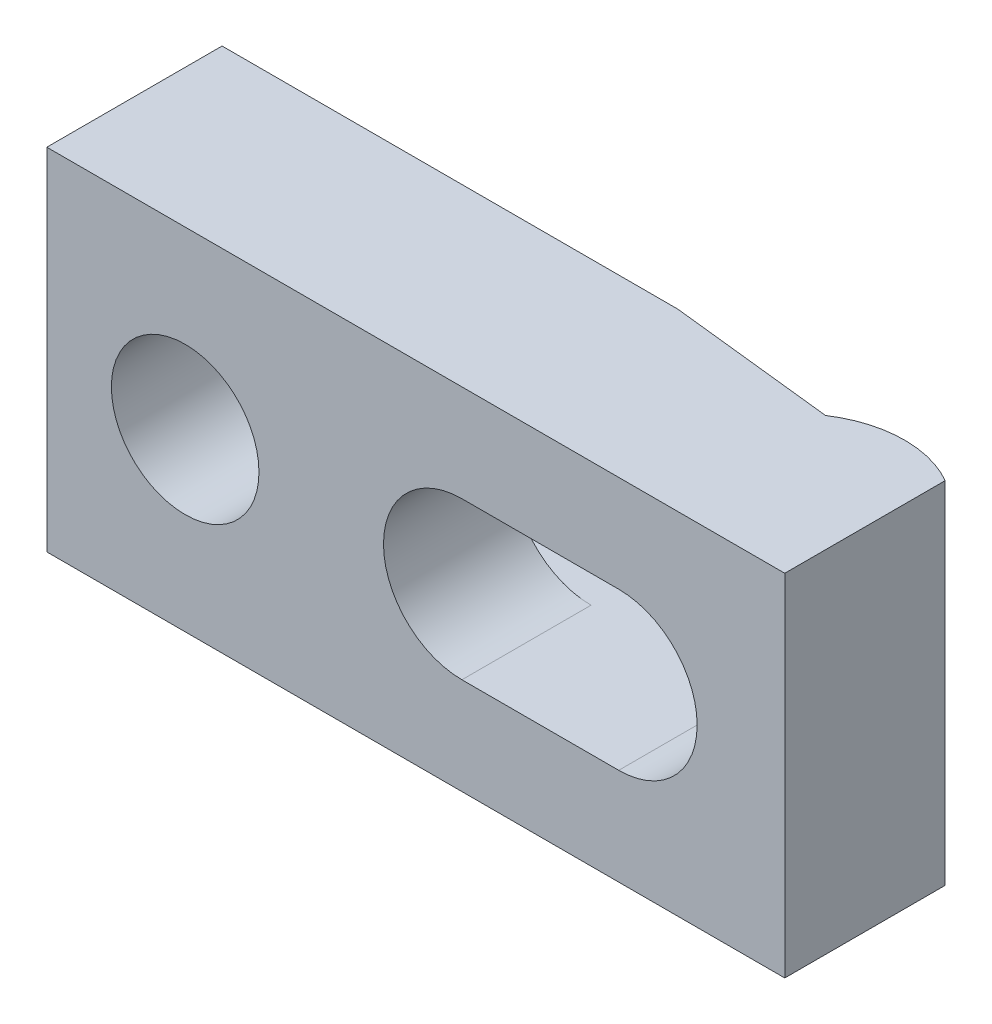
ISO-10303-21;
HEADER;
FILE_DESCRIPTION(('STEP AP214'),'2;1');
FILE_NAME('part.step','',(''),(''),'','','');
FILE_SCHEMA(('AUTOMOTIVE_DESIGN { 1 0 10303 214 1 1 1 1 }'));
ENDSEC;
DATA;
#1=APPLICATION_CONTEXT('core data for automotive mechanical design processes');
#2=APPLICATION_PROTOCOL_DEFINITION('international standard','automotive_design',2000,#1);
#3=PRODUCT_CONTEXT('',#1,'mechanical');
#4=PRODUCT('Part','Part','',(#3));
#5=PRODUCT_RELATED_PRODUCT_CATEGORY('part','',(#4));
#6=PRODUCT_DEFINITION_FORMATION('','',#4);
#7=PRODUCT_DEFINITION_CONTEXT('part definition',#1,'design');
#8=PRODUCT_DEFINITION('design','',#6,#7);
#9=PRODUCT_DEFINITION_SHAPE('','',#8);
#10=(LENGTH_UNIT() NAMED_UNIT(*) SI_UNIT(.MILLI.,.METRE.));
#11=(NAMED_UNIT(*) PLANE_ANGLE_UNIT() SI_UNIT($,.RADIAN.));
#12=(NAMED_UNIT(*) SI_UNIT($,.STERADIAN.) SOLID_ANGLE_UNIT());
#13=UNCERTAINTY_MEASURE_WITH_UNIT(LENGTH_MEASURE(1.E-05),#10,'distance_accuracy_value','');
#14=(GEOMETRIC_REPRESENTATION_CONTEXT(3) GLOBAL_UNCERTAINTY_ASSIGNED_CONTEXT((#13)) GLOBAL_UNIT_ASSIGNED_CONTEXT((#10,
#11,#12)) REPRESENTATION_CONTEXT('',''));
#15=CARTESIAN_POINT('',(0.,0.,0.));
#16=DIRECTION('',(0.,0.,1.));
#17=DIRECTION('',(1.,0.,0.));
#18=AXIS2_PLACEMENT_3D('',#15,#16,#17);
#19=CARTESIAN_POINT('',(-62.,19.,0.));
#20=DIRECTION('',(0.,0.,-1.));
#21=DIRECTION('',(-1.,0.,0.));
#22=AXIS2_PLACEMENT_3D('',#19,#20,#21);
#23=PLANE('',#22);
#24=DIRECTION('',(1.,0.,0.));
#25=VECTOR('',#24,1.);
#26=CARTESIAN_POINT('',(-17.,8.5,0.));
#27=LINE('',#26,#25);
#28=CARTESIAN_POINT('',(-62.,8.5,0.));
#29=VERTEX_POINT('',#28);
#30=CARTESIAN_POINT('',(-12.6,8.5,0.));
#31=VERTEX_POINT('',#30);
#32=EDGE_CURVE('E127',#29,#31,#27,.T.);
#33=ORIENTED_EDGE('',*,*,#32,.F.);
#34=DIRECTION('',(0.,-1.,0.));
#35=VECTOR('',#34,1.);
#36=CARTESIAN_POINT('',(-62.,19.,0.));
#37=LINE('',#36,#35);
#38=CARTESIAN_POINT('',(-62.,19.,0.));
#39=VERTEX_POINT('',#38);
#40=EDGE_CURVE('E144',#39,#29,#37,.T.);
#41=ORIENTED_EDGE('',*,*,#40,.F.);
#42=DIRECTION('',(1.,0.,0.));
#43=VECTOR('',#42,1.);
#44=CARTESIAN_POINT('',(-62.,19.,0.));
#45=LINE('',#44,#43);
#46=CARTESIAN_POINT('',(-12.6,19.,0.));
#47=VERTEX_POINT('',#46);
#48=EDGE_CURVE('E264',#39,#47,#45,.T.);
#49=ORIENTED_EDGE('',*,*,#48,.T.);
#50=DIRECTION('',(0.,-1.,0.));
#51=VECTOR('',#50,1.);
#52=CARTESIAN_POINT('',(-12.6,19.,0.));
#53=LINE('',#52,#51);
#54=EDGE_CURVE('E152',#47,#31,#53,.T.);
#55=ORIENTED_EDGE('',*,*,#54,.T.);
#56=EDGE_LOOP('',(#33,#41,#49,#55));
#57=FACE_BOUND('',#56,.T.);
#58=ADVANCED_FACE('F14',(#57),#23,.T.);
#59=CARTESIAN_POINT('',(-62.,19.,19.));
#60=DIRECTION('',(-1.,0.,0.));
#61=DIRECTION('',(0.,0.,1.));
#62=AXIS2_PLACEMENT_3D('',#59,#60,#61);
#63=PLANE('',#62);
#64=ORIENTED_EDGE('',*,*,#40,.T.);
#65=DIRECTION('',(0.,0.,1.));
#66=VECTOR('',#65,1.);
#67=CARTESIAN_POINT('',(-62.,8.5,19.));
#68=LINE('',#67,#66);
#69=CARTESIAN_POINT('',(-62.,8.5,5.));
#70=VERTEX_POINT('',#69);
#71=EDGE_CURVE('E138',#29,#70,#68,.T.);
#72=ORIENTED_EDGE('',*,*,#71,.T.);
#73=DIRECTION('',(0.,-1.,0.));
#74=VECTOR('',#73,1.);
#75=CARTESIAN_POINT('',(-62.,19.,5.));
#76=LINE('',#75,#74);
#77=CARTESIAN_POINT('',(-62.,-8.5,5.));
#78=VERTEX_POINT('',#77);
#79=EDGE_CURVE('E137',#70,#78,#76,.T.);
#80=ORIENTED_EDGE('',*,*,#79,.T.);
#81=DIRECTION('',(0.,0.,1.));
#82=VECTOR('',#81,1.);
#83=CARTESIAN_POINT('',(-62.,-8.5,19.));
#84=LINE('',#83,#82);
#85=CARTESIAN_POINT('',(-62.,-8.5,0.));
#86=VERTEX_POINT('',#85);
#87=EDGE_CURVE('E120',#86,#78,#84,.T.);
#88=ORIENTED_EDGE('',*,*,#87,.F.);
#89=CARTESIAN_POINT('',(-62.,-19.,0.));
#90=VERTEX_POINT('',#89);
#91=EDGE_CURVE('E134',#86,#90,#37,.T.);
#92=ORIENTED_EDGE('',*,*,#91,.T.);
#93=DIRECTION('',(0.,0.,-1.));
#94=VECTOR('',#93,1.);
#95=CARTESIAN_POINT('',(-62.,-19.,19.));
#96=LINE('',#95,#94);
#97=CARTESIAN_POINT('',(-62.,-19.,19.));
#98=VERTEX_POINT('',#97);
#99=EDGE_CURVE('E287',#98,#90,#96,.T.);
#100=ORIENTED_EDGE('',*,*,#99,.F.);
#101=DIRECTION('',(0.,-1.,0.));
#102=VECTOR('',#101,1.);
#103=CARTESIAN_POINT('',(-62.,19.,19.));
#104=LINE('',#103,#102);
#105=CARTESIAN_POINT('',(-62.,19.,19.));
#106=VERTEX_POINT('',#105);
#107=EDGE_CURVE('E145',#106,#98,#104,.T.);
#108=ORIENTED_EDGE('',*,*,#107,.F.);
#109=DIRECTION('',(0.,0.,-1.));
#110=VECTOR('',#109,1.);
#111=CARTESIAN_POINT('',(-62.,19.,19.));
#112=LINE('',#111,#110);
#113=EDGE_CURVE('E260',#106,#39,#112,.T.);
#114=ORIENTED_EDGE('',*,*,#113,.T.);
#115=EDGE_LOOP('',(#64,#72,#80,#88,#92,#100,#108,#114));
#116=FACE_BOUND('',#115,.T.);
#117=ADVANCED_FACE('F132',(#116),#63,.T.);
#118=CARTESIAN_POINT('',(-17.,0.,19.));
#119=DIRECTION('',(0.,0.,-1.));
#120=DIRECTION('',(-1.,0.,0.));
#121=AXIS2_PLACEMENT_3D('',#118,#119,#120);
#122=CYLINDRICAL_SURFACE('',#121,8.5);
#123=DIRECTION('',(0.,0.,-1.));
#124=VECTOR('',#123,1.);
#125=CARTESIAN_POINT('',(-17.,-8.5,19.));
#126=LINE('',#125,#124);
#127=CARTESIAN_POINT('',(-17.,-8.5,19.));
#128=VERTEX_POINT('',#127);
#129=CARTESIAN_POINT('',(-17.,-8.5,5.));
#130=VERTEX_POINT('',#129);
#131=EDGE_CURVE('E176',#128,#130,#126,.T.);
#132=ORIENTED_EDGE('',*,*,#131,.T.);
#133=CARTESIAN_POINT('',(-17.,0.,5.));
#134=DIRECTION('',(0.,0.,-1.));
#135=DIRECTION('',(-1.,0.,0.));
#136=AXIS2_PLACEMENT_3D('',#133,#134,#135);
#137=CIRCLE('',#136,8.5);
#138=CARTESIAN_POINT('',(-17.,8.5,5.));
#139=VERTEX_POINT('',#138);
#140=EDGE_CURVE('E302',#130,#139,#137,.T.);
#141=ORIENTED_EDGE('',*,*,#140,.T.);
#142=DIRECTION('',(0.,0.,-1.));
#143=VECTOR('',#142,1.);
#144=CARTESIAN_POINT('',(-17.,8.5,19.));
#145=LINE('',#144,#143);
#146=CARTESIAN_POINT('',(-17.,8.5,19.));
#147=VERTEX_POINT('',#146);
#148=EDGE_CURVE('E178',#147,#139,#145,.T.);
#149=ORIENTED_EDGE('',*,*,#148,.F.);
#150=CARTESIAN_POINT('',(-17.,0.,19.));
#151=DIRECTION('',(0.,0.,1.));
#152=DIRECTION('',(1.,0.,0.));
#153=AXIS2_PLACEMENT_3D('',#150,#151,#152);
#154=CIRCLE('',#153,8.5);
#155=EDGE_CURVE('E38',#147,#128,#154,.T.);
#156=ORIENTED_EDGE('',*,*,#155,.T.);
#157=EDGE_LOOP('',(#132,#141,#149,#156));
#158=FACE_BOUND('',#157,.T.);
#159=ADVANCED_FACE('F215',(#158),#122,.F.);
#160=CARTESIAN_POINT('',(-47.,0.,19.));
#161=DIRECTION('',(0.,0.,-1.));
#162=DIRECTION('',(-1.,0.,0.));
#163=AXIS2_PLACEMENT_3D('',#160,#161,#162);
#164=CYLINDRICAL_SURFACE('',#163,8.);
#165=CARTESIAN_POINT('',(-47.,0.,19.));
#166=DIRECTION('',(0.,0.,1.));
#167=DIRECTION('',(1.,0.,0.));
#168=AXIS2_PLACEMENT_3D('',#165,#166,#167);
#169=CIRCLE('',#168,8.);
#170=CARTESIAN_POINT('',(-39.,0.,19.));
#171=VERTEX_POINT('',#170);
#172=EDGE_CURVE('E256',#171,#171,#169,.T.);
#173=ORIENTED_EDGE('',*,*,#172,.T.);
#174=EDGE_LOOP('',(#173));
#175=FACE_BOUND('',#174,.T.);
#176=CARTESIAN_POINT('',(-47.,0.,5.));
#177=DIRECTION('',(0.,0.,-1.));
#178=DIRECTION('',(-1.,0.,0.));
#179=AXIS2_PLACEMENT_3D('',#176,#177,#178);
#180=CIRCLE('',#179,8.);
#181=CARTESIAN_POINT('',(-55.,0.,5.));
#182=VERTEX_POINT('',#181);
#183=EDGE_CURVE('E18',#182,#182,#180,.T.);
#184=ORIENTED_EDGE('',*,*,#183,.T.);
#185=EDGE_LOOP('',(#184));
#186=FACE_BOUND('',#185,.T.);
#187=ADVANCED_FACE('F210',(#175,#186),#164,.F.);
#188=CARTESIAN_POINT('',(18.,19.,19.));
#189=DIRECTION('',(0.,0.,1.));
#190=DIRECTION('',(1.,0.,0.));
#191=AXIS2_PLACEMENT_3D('',#188,#189,#190);
#192=PLANE('',#191);
#193=DIRECTION('',(1.,0.,0.));
#194=VECTOR('',#193,1.);
#195=CARTESIAN_POINT('',(-17.,8.5,19.));
#196=LINE('',#195,#194);
#197=CARTESIAN_POINT('',(0.,8.5,19.));
#198=VERTEX_POINT('',#197);
#199=EDGE_CURVE('E296',#147,#198,#196,.T.);
#200=ORIENTED_EDGE('',*,*,#199,.T.);
#201=CARTESIAN_POINT('',(0.,0.,19.));
#202=DIRECTION('',(0.,0.,1.));
#203=DIRECTION('',(1.,0.,0.));
#204=AXIS2_PLACEMENT_3D('',#201,#202,#203);
#205=CIRCLE('',#204,8.5);
#206=CARTESIAN_POINT('',(0.,-8.5,19.));
#207=VERTEX_POINT('',#206);
#208=EDGE_CURVE('E126',#207,#198,#205,.T.);
#209=ORIENTED_EDGE('',*,*,#208,.F.);
#210=DIRECTION('',(-1.,0.,0.));
#211=VECTOR('',#210,1.);
#212=CARTESIAN_POINT('',(0.,-8.5,19.));
#213=LINE('',#212,#211);
#214=EDGE_CURVE('E174',#207,#128,#213,.T.);
#215=ORIENTED_EDGE('',*,*,#214,.T.);
#216=ORIENTED_EDGE('',*,*,#155,.F.);
#217=EDGE_LOOP('',(#200,#209,#215,#216));
#218=FACE_BOUND('',#217,.T.);
#219=DIRECTION('',(0.,-1.,0.));
#220=VECTOR('',#219,1.);
#221=CARTESIAN_POINT('',(18.,19.,19.));
#222=LINE('',#221,#220);
#223=CARTESIAN_POINT('',(18.,19.,19.));
#224=VERTEX_POINT('',#223);
#225=CARTESIAN_POINT('',(18.,-19.,19.));
#226=VERTEX_POINT('',#225);
#227=EDGE_CURVE('E161',#224,#226,#222,.T.);
#228=ORIENTED_EDGE('',*,*,#227,.F.);
#229=DIRECTION('',(-1.,0.,0.));
#230=VECTOR('',#229,1.);
#231=CARTESIAN_POINT('',(18.,19.,19.));
#232=LINE('',#231,#230);
#233=EDGE_CURVE('E265',#224,#106,#232,.T.);
#234=ORIENTED_EDGE('',*,*,#233,.T.);
#235=ORIENTED_EDGE('',*,*,#107,.T.);
#236=DIRECTION('',(-1.,0.,0.));
#237=VECTOR('',#236,1.);
#238=CARTESIAN_POINT('',(18.,-19.,19.));
#239=LINE('',#238,#237);
#240=EDGE_CURVE('E198',#226,#98,#239,.T.);
#241=ORIENTED_EDGE('',*,*,#240,.F.);
#242=EDGE_LOOP('',(#228,#234,#235,#241));
#243=FACE_BOUND('',#242,.T.);
#244=ORIENTED_EDGE('',*,*,#172,.F.);
#245=EDGE_LOOP('',(#244));
#246=FACE_BOUND('',#245,.T.);
#247=ADVANCED_FACE('F228',(#218,#243,#246),#192,.T.);
#248=ORIENTED_EDGE('',*,*,#91,.F.);
#249=DIRECTION('',(-1.,0.,0.));
#250=VECTOR('',#249,1.);
#251=CARTESIAN_POINT('',(0.,-8.5,0.));
#252=LINE('',#251,#250);
#253=CARTESIAN_POINT('',(-12.6,-8.5,0.));
#254=VERTEX_POINT('',#253);
#255=EDGE_CURVE('E115',#254,#86,#252,.T.);
#256=ORIENTED_EDGE('',*,*,#255,.F.);
#257=CARTESIAN_POINT('',(-12.6,-19.,0.));
#258=VERTEX_POINT('',#257);
#259=EDGE_CURVE('E147',#254,#258,#53,.T.);
#260=ORIENTED_EDGE('',*,*,#259,.T.);
#261=DIRECTION('',(1.,0.,0.));
#262=VECTOR('',#261,1.);
#263=CARTESIAN_POINT('',(-62.,-19.,0.));
#264=LINE('',#263,#262);
#265=EDGE_CURVE('E143',#90,#258,#264,.T.);
#266=ORIENTED_EDGE('',*,*,#265,.F.);
#267=EDGE_LOOP('',(#248,#256,#260,#266));
#268=FACE_BOUND('',#267,.T.);
#269=ADVANCED_FACE('F141',(#268),#23,.T.);
#270=CARTESIAN_POINT('',(12.,19.,12.));
#271=DIRECTION('',(0.,-1.,0.));
#272=DIRECTION('',(0.,0.,-1.));
#273=AXIS2_PLACEMENT_3D('',#270,#271,#272);
#274=CYLINDRICAL_SURFACE('',#273,12.);
#275=CARTESIAN_POINT('',(4.88274196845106,6.95764549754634,2.33849710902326));
#276=CARTESIAN_POINT('',(4.96289416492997,6.90139795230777,2.27944974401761));
#277=CARTESIAN_POINT('',(5.04288078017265,6.84319519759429,2.22206819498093));
#278=CARTESIAN_POINT('',(5.20221876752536,6.72286300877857,2.11063118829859));
#279=CARTESIAN_POINT('',(5.28157012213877,6.66073346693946,2.05657582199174));
#280=CARTESIAN_POINT('',(5.51815632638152,6.46847749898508,1.89943009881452));
#281=CARTESIAN_POINT('',(5.67397678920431,6.332446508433,1.80132102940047));
#282=CARTESIAN_POINT('',(5.97850407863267,6.0457476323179,1.61862135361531));
#283=CARTESIAN_POINT('',(6.12723722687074,5.89514143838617,1.53397746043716));
#284=CARTESIAN_POINT('',(6.41585346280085,5.57965162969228,1.37718119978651));
#285=CARTESIAN_POINT('',(6.55573770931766,5.41476989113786,1.30502719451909));
#286=CARTESIAN_POINT('',(6.8145803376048,5.08450865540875,1.17730608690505));
#287=CARTESIAN_POINT('',(6.93432113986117,4.9200607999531,1.12090859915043));
#288=CARTESIAN_POINT('',(7.1628607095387,4.580963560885,1.01738532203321));
#289=CARTESIAN_POINT('',(7.27165956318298,4.40631425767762,0.970259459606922));
#290=CARTESIAN_POINT('',(7.47706112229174,4.04798867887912,0.884451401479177));
#291=CARTESIAN_POINT('',(7.57366270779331,3.86431157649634,0.845769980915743));
#292=CARTESIAN_POINT('',(7.75363111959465,3.48919533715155,0.776022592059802));
#293=CARTESIAN_POINT('',(7.83699769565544,3.29775605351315,0.744956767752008));
#294=CARTESIAN_POINT('',(7.99162682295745,2.90342724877,0.688948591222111));
#295=CARTESIAN_POINT('',(8.06252602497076,2.70037017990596,0.664182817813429));
#296=CARTESIAN_POINT('',(8.18886726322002,2.28883979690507,0.621084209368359));
#297=CARTESIAN_POINT('',(8.24430905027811,2.08036639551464,0.602751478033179));
#298=CARTESIAN_POINT('',(8.33926029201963,1.65931646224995,0.571899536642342));
#299=CARTESIAN_POINT('',(8.37876353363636,1.4467383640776,0.559382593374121));
#300=CARTESIAN_POINT('',(8.44147433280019,1.01894574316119,0.539721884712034));
#301=CARTESIAN_POINT('',(8.46468149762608,0.803731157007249,0.532578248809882));
#302=CARTESIAN_POINT('',(8.49526468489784,0.362594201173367,0.523192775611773));
#303=CARTESIAN_POINT('',(8.5019032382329,0.136615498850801,0.521179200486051));
#304=CARTESIAN_POINT('',(8.49715935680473,-0.315139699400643,0.522626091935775));
#305=CARTESIAN_POINT('',(8.48577636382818,-0.54091618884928,0.526086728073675));
#306=CARTESIAN_POINT('',(8.44508332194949,-0.99074640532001,0.538629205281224));
#307=CARTESIAN_POINT('',(8.41576906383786,-1.21479971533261,0.547712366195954));
#308=CARTESIAN_POINT('',(8.33947208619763,-1.65955134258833,0.57187091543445));
#309=CARTESIAN_POINT('',(8.29248941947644,-1.8802496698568,0.586946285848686));
#310=CARTESIAN_POINT('',(8.18074635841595,-2.31885831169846,0.623849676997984));
#311=CARTESIAN_POINT('',(8.11581556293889,-2.53671981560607,0.64574269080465));
#312=CARTESIAN_POINT('',(7.9690403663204,-2.96577141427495,0.69701797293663));
#313=CARTESIAN_POINT('',(7.88719573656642,-3.1769614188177,0.726400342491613));
#314=CARTESIAN_POINT('',(7.70756245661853,-3.59086813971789,0.793566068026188));
#315=CARTESIAN_POINT('',(7.60978644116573,-3.79359141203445,0.831342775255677));
#316=CARTESIAN_POINT('',(7.39941695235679,-4.18912826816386,0.916341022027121));
#317=CARTESIAN_POINT('',(7.2868241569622,-4.38194230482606,0.963562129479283));
#318=CARTESIAN_POINT('',(7.05185225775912,-4.75054926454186,1.06693987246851));
#319=CARTESIAN_POINT('',(6.92986466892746,-4.92667815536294,1.12278836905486));
#320=CARTESIAN_POINT('',(6.6749673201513,-5.26687601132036,1.2452796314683));
#321=CARTESIAN_POINT('',(6.54205760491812,-5.43094502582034,1.31192235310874));
#322=CARTESIAN_POINT('',(6.26715467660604,-5.74599913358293,1.45682073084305));
#323=CARTESIAN_POINT('',(6.12515627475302,-5.89697663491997,1.53508305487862));
#324=CARTESIAN_POINT('',(5.83431556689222,-6.18487062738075,1.70375894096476));
#325=CARTESIAN_POINT('',(5.68547391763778,-6.32178846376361,1.79417133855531));
#326=CARTESIAN_POINT('',(5.39040111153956,-6.5749196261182,1.9828945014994));
#327=CARTESIAN_POINT('',(5.24437821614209,-6.69180509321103,2.08063121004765));
#328=CARTESIAN_POINT('',(4.95026496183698,-6.91221087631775,2.28745286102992));
#329=CARTESIAN_POINT('',(4.80217435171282,-7.01572955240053,2.39653919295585));
#330=CARTESIAN_POINT('',(4.50582642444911,-7.209639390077,2.62596996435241));
#331=CARTESIAN_POINT('',(4.35756909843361,-7.30001639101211,2.7463263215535));
#332=CARTESIAN_POINT('',(4.06296523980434,-7.46800992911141,2.99770891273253));
#333=CARTESIAN_POINT('',(3.91661814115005,-7.5456303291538,3.12873189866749));
#334=CARTESIAN_POINT('',(3.77213987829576,-7.61714912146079,3.2648802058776));
#335=B_SPLINE_CURVE_WITH_KNOTS('',3,(#275,#276,#277,#278,#279,#280,#281,#282,#283,#284,#285,
#286,#287,#288,#289,#290,#291,#292,#293,#294,#295,#296,#297,#298,#299,#300,#301,#302,#303,#304,
#305,#306,#307,#308,#309,#310,#311,#312,#313,#314,#315,#316,#317,#318,#319,#320,#321,#322,#323,
#324,#325,#326,#327,#328,#329,#330,#331,#332,#333,#334),.UNSPECIFIED.,.F.,.F.,(4,2,2,2,2,2,2,2,
2,2,2,2,2,2,2,2,2,2,2,2,2,2,2,2,2,2,2,2,2,4),(0.,0.342975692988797,0.685960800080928,
1.37170393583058,2.05466192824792,2.73753029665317,3.37008860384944,4.00264192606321,
4.63525328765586,5.26787660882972,5.91665067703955,6.5654352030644,7.2144723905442,
7.8635252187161,8.54098997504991,9.21847571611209,9.89612055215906,10.5737633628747,
11.2580748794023,11.9423956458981,12.6261763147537,13.3099257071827,13.9733036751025,
14.6366789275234,15.3004363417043,15.9641301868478,16.5965045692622,17.2289564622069,
17.8620848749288,18.4950212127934),.UNSPECIFIED.);
#336=CARTESIAN_POINT('',(5.4,6.56429737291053,1.97802414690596));
#337=VERTEX_POINT('',#336);
#338=CARTESIAN_POINT('',(5.4,-6.56429737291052,1.97802414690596));
#339=VERTEX_POINT('',#338);
#340=EDGE_CURVE('E170',#337,#339,#335,.T.);
#341=ORIENTED_EDGE('',*,*,#340,.F.);
#342=DIRECTION('',(0.,-1.,0.));
#343=VECTOR('',#342,1.);
#344=CARTESIAN_POINT('',(5.4,19.,1.97802414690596));
#345=LINE('',#344,#343);
#346=CARTESIAN_POINT('',(5.4,19.,1.97802414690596));
#347=VERTEX_POINT('',#346);
#348=EDGE_CURVE('E156',#347,#337,#345,.T.);
#349=ORIENTED_EDGE('',*,*,#348,.F.);
#350=CARTESIAN_POINT('',(12.,19.,12.));
#351=DIRECTION('',(0.,1.,0.));
#352=DIRECTION('',(0.,0.,1.));
#353=AXIS2_PLACEMENT_3D('',#350,#351,#352);
#354=CIRCLE('',#353,12.);
#355=CARTESIAN_POINT('',(18.,19.,1.60769515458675));
#356=VERTEX_POINT('',#355);
#357=EDGE_CURVE('E272',#356,#347,#354,.T.);
#358=ORIENTED_EDGE('',*,*,#357,.F.);
#359=DIRECTION('',(0.,-1.,0.));
#360=VECTOR('',#359,1.);
#361=CARTESIAN_POINT('',(18.,19.,1.60769515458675));
#362=LINE('',#361,#360);
#363=CARTESIAN_POINT('',(18.,-19.,1.60769515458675));
#364=VERTEX_POINT('',#363);
#365=EDGE_CURVE('E159',#356,#364,#362,.T.);
#366=ORIENTED_EDGE('',*,*,#365,.T.);
#367=CARTESIAN_POINT('',(12.,-19.,12.));
#368=DIRECTION('',(0.,1.,0.));
#369=DIRECTION('',(0.,0.,1.));
#370=AXIS2_PLACEMENT_3D('',#367,#368,#369);
#371=CIRCLE('',#370,12.);
#372=CARTESIAN_POINT('',(5.4,-19.,1.97802414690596));
#373=VERTEX_POINT('',#372);
#374=EDGE_CURVE('E277',#364,#373,#371,.T.);
#375=ORIENTED_EDGE('',*,*,#374,.T.);
#376=EDGE_CURVE('E155',#339,#373,#345,.T.);
#377=ORIENTED_EDGE('',*,*,#376,.F.);
#378=EDGE_LOOP('',(#341,#349,#358,#366,#375,#377));
#379=FACE_BOUND('',#378,.T.);
#380=ADVANCED_FACE('F201',(#379),#274,.T.);
#381=CARTESIAN_POINT('',(5.4,19.,1.97802414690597));
#382=DIRECTION('',(-0.109232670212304,0.,0.99401620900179));
#383=DIRECTION('',(0.99401620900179,0.,0.109232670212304));
#384=AXIS2_PLACEMENT_3D('',#381,#382,#383);
#385=PLANE('',#384);
#386=CARTESIAN_POINT('',(0.,0.,1.38461690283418));
#387=DIRECTION('',(-0.109232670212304,0.,0.99401620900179));
#388=DIRECTION('',(-0.99401620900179,0.,-0.109232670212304));
#389=AXIS2_PLACEMENT_3D('',#386,#387,#388);
#390=ELLIPSE('',#389,8.55116840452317,8.5);
#391=CARTESIAN_POINT('',(0.,8.5,1.38461690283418));
#392=VERTEX_POINT('',#391);
#393=EDGE_CURVE('E9',#392,#337,#390,.F.);
#394=ORIENTED_EDGE('',*,*,#393,.F.);
#395=DIRECTION('',(-0.99401620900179,0.,-0.109232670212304));
#396=VECTOR('',#395,1.);
#397=CARTESIAN_POINT('',(5.4,8.5,1.97802414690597));
#398=LINE('',#397,#396);
#399=EDGE_CURVE('E190',#392,#31,#398,.T.);
#400=ORIENTED_EDGE('',*,*,#399,.T.);
#401=ORIENTED_EDGE('',*,*,#54,.F.);
#402=DIRECTION('',(-0.99401620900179,0.,-0.109232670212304));
#403=VECTOR('',#402,1.);
#404=CARTESIAN_POINT('',(5.4,19.,1.97802414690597));
#405=LINE('',#404,#403);
#406=EDGE_CURVE('E270',#347,#47,#405,.T.);
#407=ORIENTED_EDGE('',*,*,#406,.F.);
#408=ORIENTED_EDGE('',*,*,#348,.T.);
#409=EDGE_LOOP('',(#394,#400,#401,#407,#408));
#410=FACE_BOUND('',#409,.T.);
#411=ADVANCED_FACE('F235',(#410),#385,.F.);
#412=CARTESIAN_POINT('',(0.,-8.5,1.38461690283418));
#413=VERTEX_POINT('',#412);
#414=EDGE_CURVE('E23',#339,#413,#390,.F.);
#415=ORIENTED_EDGE('',*,*,#414,.F.);
#416=ORIENTED_EDGE('',*,*,#376,.T.);
#417=DIRECTION('',(-0.99401620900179,0.,-0.109232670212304));
#418=VECTOR('',#417,1.);
#419=CARTESIAN_POINT('',(5.4,-19.,1.97802414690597));
#420=LINE('',#419,#418);
#421=EDGE_CURVE('E281',#373,#258,#420,.T.);
#422=ORIENTED_EDGE('',*,*,#421,.T.);
#423=ORIENTED_EDGE('',*,*,#259,.F.);
#424=DIRECTION('',(0.99401620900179,0.,0.109232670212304));
#425=VECTOR('',#424,1.);
#426=CARTESIAN_POINT('',(5.4,-8.5,1.97802414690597));
#427=LINE('',#426,#425);
#428=EDGE_CURVE('E122',#254,#413,#427,.T.);
#429=ORIENTED_EDGE('',*,*,#428,.T.);
#430=EDGE_LOOP('',(#415,#416,#422,#423,#429));
#431=FACE_BOUND('',#430,.T.);
#432=ADVANCED_FACE('F237',(#431),#385,.F.);
#433=CARTESIAN_POINT('',(18.,19.,19.));
#434=DIRECTION('',(-1.,0.,0.));
#435=DIRECTION('',(0.,0.,1.));
#436=AXIS2_PLACEMENT_3D('',#433,#434,#435);
#437=PLANE('',#436);
#438=ORIENTED_EDGE('',*,*,#365,.F.);
#439=DIRECTION('',(0.,0.,-1.));
#440=VECTOR('',#439,1.);
#441=CARTESIAN_POINT('',(18.,19.,19.));
#442=LINE('',#441,#440);
#443=EDGE_CURVE('E148',#224,#356,#442,.T.);
#444=ORIENTED_EDGE('',*,*,#443,.F.);
#445=ORIENTED_EDGE('',*,*,#227,.T.);
#446=DIRECTION('',(0.,0.,-1.));
#447=VECTOR('',#446,1.);
#448=CARTESIAN_POINT('',(18.,-19.,19.));
#449=LINE('',#448,#447);
#450=EDGE_CURVE('E199',#226,#364,#449,.T.);
#451=ORIENTED_EDGE('',*,*,#450,.T.);
#452=EDGE_LOOP('',(#438,#444,#445,#451));
#453=FACE_BOUND('',#452,.T.);
#454=ADVANCED_FACE('F16',(#453),#437,.F.);
#455=CARTESIAN_POINT('',(12.,19.,12.));
#456=DIRECTION('',(0.,1.,0.));
#457=DIRECTION('',(0.,0.,1.));
#458=AXIS2_PLACEMENT_3D('',#455,#456,#457);
#459=PLANE('',#458);
#460=ORIENTED_EDGE('',*,*,#233,.F.);
#461=ORIENTED_EDGE('',*,*,#443,.T.);
#462=ORIENTED_EDGE('',*,*,#357,.T.);
#463=ORIENTED_EDGE('',*,*,#406,.T.);
#464=ORIENTED_EDGE('',*,*,#48,.F.);
#465=ORIENTED_EDGE('',*,*,#113,.F.);
#466=EDGE_LOOP('',(#460,#461,#462,#463,#464,#465));
#467=FACE_BOUND('',#466,.T.);
#468=ADVANCED_FACE('F223',(#467),#459,.T.);
#469=CARTESIAN_POINT('',(12.,-19.,12.));
#470=DIRECTION('',(0.,1.,0.));
#471=DIRECTION('',(0.,0.,1.));
#472=AXIS2_PLACEMENT_3D('',#469,#470,#471);
#473=PLANE('',#472);
#474=ORIENTED_EDGE('',*,*,#240,.T.);
#475=ORIENTED_EDGE('',*,*,#99,.T.);
#476=ORIENTED_EDGE('',*,*,#265,.T.);
#477=ORIENTED_EDGE('',*,*,#421,.F.);
#478=ORIENTED_EDGE('',*,*,#374,.F.);
#479=ORIENTED_EDGE('',*,*,#450,.F.);
#480=EDGE_LOOP('',(#474,#475,#476,#477,#478,#479));
#481=FACE_BOUND('',#480,.T.);
#482=ADVANCED_FACE('F209',(#481),#473,.F.);
#483=CARTESIAN_POINT('',(0.,0.,19.));
#484=DIRECTION('',(0.,0.,-1.));
#485=DIRECTION('',(-1.,0.,0.));
#486=AXIS2_PLACEMENT_3D('',#483,#484,#485);
#487=CYLINDRICAL_SURFACE('',#486,8.5);
#488=ORIENTED_EDGE('',*,*,#393,.T.);
#489=ORIENTED_EDGE('',*,*,#340,.T.);
#490=ORIENTED_EDGE('',*,*,#414,.T.);
#491=DIRECTION('',(0.,0.,-1.));
#492=VECTOR('',#491,1.);
#493=CARTESIAN_POINT('',(0.,-8.5,19.));
#494=LINE('',#493,#492);
#495=EDGE_CURVE('E167',#207,#413,#494,.T.);
#496=ORIENTED_EDGE('',*,*,#495,.F.);
#497=ORIENTED_EDGE('',*,*,#208,.T.);
#498=DIRECTION('',(0.,0.,-1.));
#499=VECTOR('',#498,1.);
#500=CARTESIAN_POINT('',(0.,8.5,19.));
#501=LINE('',#500,#499);
#502=EDGE_CURVE('E186',#198,#392,#501,.T.);
#503=ORIENTED_EDGE('',*,*,#502,.T.);
#504=EDGE_LOOP('',(#488,#489,#490,#496,#497,#503));
#505=FACE_BOUND('',#504,.T.);
#506=ADVANCED_FACE('F165',(#505),#487,.F.);
#507=CARTESIAN_POINT('',(-17.,8.5,19.));
#508=DIRECTION('',(0.,1.,0.));
#509=DIRECTION('',(0.,0.,1.));
#510=AXIS2_PLACEMENT_3D('',#507,#508,#509);
#511=PLANE('',#510);
#512=ORIENTED_EDGE('',*,*,#32,.T.);
#513=ORIENTED_EDGE('',*,*,#399,.F.);
#514=ORIENTED_EDGE('',*,*,#502,.F.);
#515=ORIENTED_EDGE('',*,*,#199,.F.);
#516=ORIENTED_EDGE('',*,*,#148,.T.);
#517=DIRECTION('',(-1.,0.,0.));
#518=VECTOR('',#517,1.);
#519=CARTESIAN_POINT('',(-2.,8.5,5.));
#520=LINE('',#519,#518);
#521=EDGE_CURVE('E30',#139,#70,#520,.T.);
#522=ORIENTED_EDGE('',*,*,#521,.T.);
#523=ORIENTED_EDGE('',*,*,#71,.F.);
#524=EDGE_LOOP('',(#512,#513,#514,#515,#516,#522,#523));
#525=FACE_BOUND('',#524,.T.);
#526=ADVANCED_FACE('F208',(#525),#511,.F.);
#527=CARTESIAN_POINT('',(0.,-8.5,19.));
#528=DIRECTION('',(0.,-1.,0.));
#529=DIRECTION('',(1.,0.,0.));
#530=AXIS2_PLACEMENT_3D('',#527,#528,#529);
#531=PLANE('',#530);
#532=ORIENTED_EDGE('',*,*,#495,.T.);
#533=ORIENTED_EDGE('',*,*,#428,.F.);
#534=ORIENTED_EDGE('',*,*,#255,.T.);
#535=ORIENTED_EDGE('',*,*,#87,.T.);
#536=DIRECTION('',(-1.,0.,0.));
#537=VECTOR('',#536,1.);
#538=CARTESIAN_POINT('',(-2.,-8.5,5.));
#539=LINE('',#538,#537);
#540=EDGE_CURVE('E304',#130,#78,#539,.T.);
#541=ORIENTED_EDGE('',*,*,#540,.F.);
#542=ORIENTED_EDGE('',*,*,#131,.F.);
#543=ORIENTED_EDGE('',*,*,#214,.F.);
#544=EDGE_LOOP('',(#532,#533,#534,#535,#541,#542,#543));
#545=FACE_BOUND('',#544,.T.);
#546=ADVANCED_FACE('F118',(#545),#531,.F.);
#547=CARTESIAN_POINT('',(-2.,-8.5,5.));
#548=DIRECTION('',(0.,0.,-1.));
#549=DIRECTION('',(-1.,0.,0.));
#550=AXIS2_PLACEMENT_3D('',#547,#548,#549);
#551=PLANE('',#550);
#552=ORIENTED_EDGE('',*,*,#183,.F.);
#553=EDGE_LOOP('',(#552));
#554=FACE_BOUND('',#553,.T.);
#555=ORIENTED_EDGE('',*,*,#521,.F.);
#556=ORIENTED_EDGE('',*,*,#140,.F.);
#557=ORIENTED_EDGE('',*,*,#540,.T.);
#558=ORIENTED_EDGE('',*,*,#79,.F.);
#559=EDGE_LOOP('',(#555,#556,#557,#558));
#560=FACE_BOUND('',#559,.T.);
#561=ADVANCED_FACE('F214',(#554,#560),#551,.T.);
#562=CLOSED_SHELL('',(#58,#117,#159,#187,#247,#269,#380,#411,#432,#454,#468,#482,#506,#526,#546,#561));
#563=MANIFOLD_SOLID_BREP('B1',#562);
#564=ADVANCED_BREP_SHAPE_REPRESENTATION('',(#18,#563),#14);
#565=SHAPE_DEFINITION_REPRESENTATION(#9,#564);
ENDSEC;
END-ISO-10303-21;
